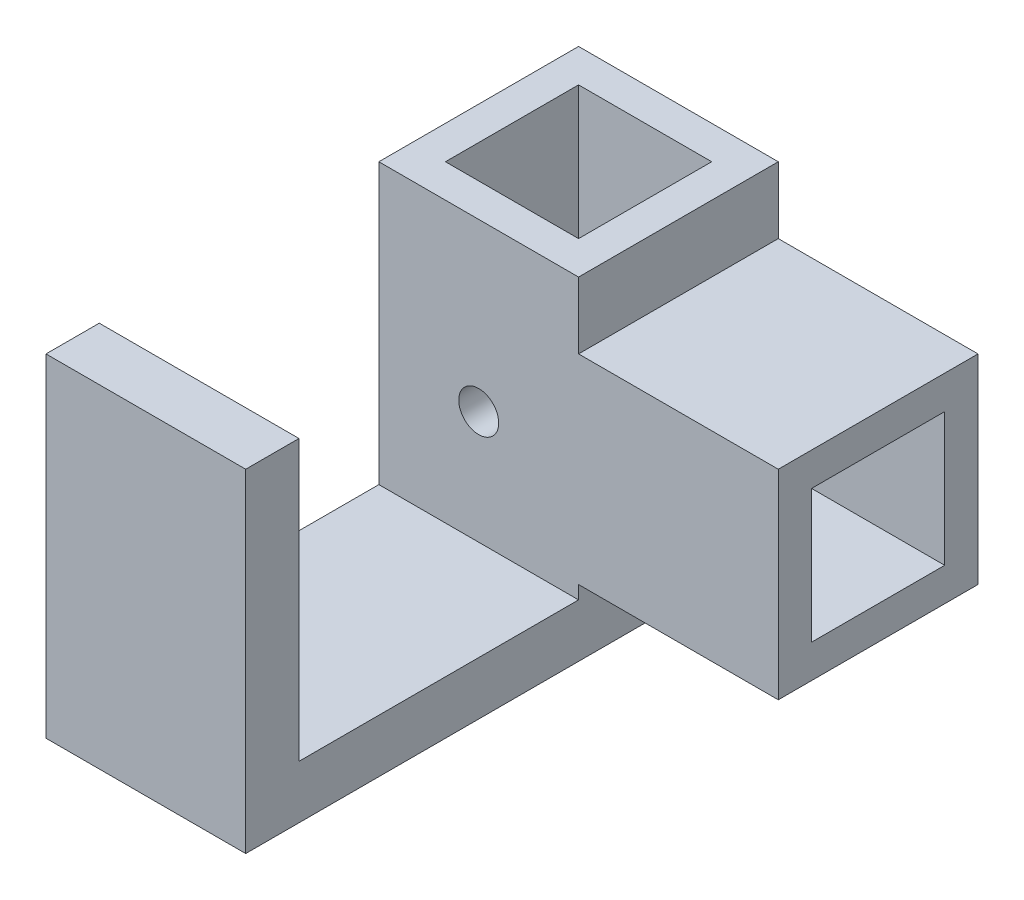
ISO-10303-21;
HEADER;
FILE_DESCRIPTION(('STEP AP214'),'2;1');
FILE_NAME('part.step','',(''),(''),'','','');
FILE_SCHEMA(('AUTOMOTIVE_DESIGN { 1 0 10303 214 1 1 1 1 }'));
ENDSEC;
DATA;
#1=APPLICATION_CONTEXT('core data for automotive mechanical design processes');
#2=APPLICATION_PROTOCOL_DEFINITION('international standard','automotive_design',2000,#1);
#3=PRODUCT_CONTEXT('',#1,'mechanical');
#4=PRODUCT('Part','Part','',(#3));
#5=PRODUCT_RELATED_PRODUCT_CATEGORY('part','',(#4));
#6=PRODUCT_DEFINITION_FORMATION('','',#4);
#7=PRODUCT_DEFINITION_CONTEXT('part definition',#1,'design');
#8=PRODUCT_DEFINITION('design','',#6,#7);
#9=PRODUCT_DEFINITION_SHAPE('','',#8);
#10=(LENGTH_UNIT() NAMED_UNIT(*) SI_UNIT(.MILLI.,.METRE.));
#11=(NAMED_UNIT(*) PLANE_ANGLE_UNIT() SI_UNIT($,.RADIAN.));
#12=(NAMED_UNIT(*) SI_UNIT($,.STERADIAN.) SOLID_ANGLE_UNIT());
#13=UNCERTAINTY_MEASURE_WITH_UNIT(LENGTH_MEASURE(1.E-05),#10,'distance_accuracy_value','');
#14=(GEOMETRIC_REPRESENTATION_CONTEXT(3) GLOBAL_UNCERTAINTY_ASSIGNED_CONTEXT((#13)) GLOBAL_UNIT_ASSIGNED_CONTEXT((#10,
#11,#12)) REPRESENTATION_CONTEXT('',''));
#15=CARTESIAN_POINT('',(0.,0.,0.));
#16=DIRECTION('',(0.,0.,1.));
#17=DIRECTION('',(1.,0.,0.));
#18=AXIS2_PLACEMENT_3D('',#15,#16,#17);
#19=CARTESIAN_POINT('',(0.,0.,15.));
#20=DIRECTION('',(0.,0.,1.));
#21=DIRECTION('',(1.,0.,0.));
#22=AXIS2_PLACEMENT_3D('',#19,#20,#21);
#23=PLANE('',#22);
#24=CARTESIAN_POINT('',(0.,0.,15.));
#25=DIRECTION('',(0.,0.,1.));
#26=DIRECTION('',(1.,0.,0.));
#27=AXIS2_PLACEMENT_3D('',#24,#25,#26);
#28=CIRCLE('',#27,3.);
#29=CARTESIAN_POINT('',(3.,0.,15.));
#30=VERTEX_POINT('',#29);
#31=EDGE_CURVE('E318',#30,#30,#28,.T.);
#32=ORIENTED_EDGE('',*,*,#31,.F.);
#33=EDGE_LOOP('',(#32));
#34=FACE_BOUND('',#33,.T.);
#35=DIRECTION('',(0.,-1.,0.));
#36=VECTOR('',#35,1.);
#37=CARTESIAN_POINT('',(-15.,-25.,15.));
#38=LINE('',#37,#36);
#39=CARTESIAN_POINT('',(-15.,25.,15.));
#40=VERTEX_POINT('',#39);
#41=CARTESIAN_POINT('',(-15.,-17.,15.));
#42=VERTEX_POINT('',#41);
#43=EDGE_CURVE('E330',#40,#42,#38,.T.);
#44=ORIENTED_EDGE('',*,*,#43,.T.);
#45=DIRECTION('',(1.,0.,0.));
#46=VECTOR('',#45,1.);
#47=CARTESIAN_POINT('',(-15.,-17.,15.));
#48=LINE('',#47,#46);
#49=CARTESIAN_POINT('',(15.,-17.,15.));
#50=VERTEX_POINT('',#49);
#51=EDGE_CURVE('E225',#42,#50,#48,.T.);
#52=ORIENTED_EDGE('',*,*,#51,.T.);
#53=DIRECTION('',(0.,1.,0.));
#54=VECTOR('',#53,1.);
#55=CARTESIAN_POINT('',(15.,-25.,15.));
#56=LINE('',#55,#54);
#57=CARTESIAN_POINT('',(15.,-15.,15.));
#58=VERTEX_POINT('',#57);
#59=EDGE_CURVE('E203',#50,#58,#56,.T.);
#60=ORIENTED_EDGE('',*,*,#59,.T.);
#61=DIRECTION('',(1.,0.,0.));
#62=VECTOR('',#61,1.);
#63=CARTESIAN_POINT('',(15.,-15.,15.));
#64=LINE('',#63,#62);
#65=CARTESIAN_POINT('',(45.,-15.,15.));
#66=VERTEX_POINT('',#65);
#67=EDGE_CURVE('E337',#58,#66,#64,.T.);
#68=ORIENTED_EDGE('',*,*,#67,.T.);
#69=DIRECTION('',(0.,1.,0.));
#70=VECTOR('',#69,1.);
#71=CARTESIAN_POINT('',(45.,15.,15.));
#72=LINE('',#71,#70);
#73=CARTESIAN_POINT('',(45.,15.,15.));
#74=VERTEX_POINT('',#73);
#75=EDGE_CURVE('E340',#66,#74,#72,.T.);
#76=ORIENTED_EDGE('',*,*,#75,.T.);
#77=DIRECTION('',(-1.,0.,0.));
#78=VECTOR('',#77,1.);
#79=CARTESIAN_POINT('',(15.,15.,15.));
#80=LINE('',#79,#78);
#81=CARTESIAN_POINT('',(15.,15.,15.));
#82=VERTEX_POINT('',#81);
#83=EDGE_CURVE('E343',#74,#82,#80,.T.);
#84=ORIENTED_EDGE('',*,*,#83,.T.);
#85=DIRECTION('',(0.,1.,0.));
#86=VECTOR('',#85,1.);
#87=CARTESIAN_POINT('',(15.,15.,15.));
#88=LINE('',#87,#86);
#89=CARTESIAN_POINT('',(15.,25.,15.));
#90=VERTEX_POINT('',#89);
#91=EDGE_CURVE('E346',#82,#90,#88,.T.);
#92=ORIENTED_EDGE('',*,*,#91,.T.);
#93=DIRECTION('',(-1.,0.,0.));
#94=VECTOR('',#93,1.);
#95=CARTESIAN_POINT('',(-15.,25.,15.));
#96=LINE('',#95,#94);
#97=EDGE_CURVE('E326',#90,#40,#96,.T.);
#98=ORIENTED_EDGE('',*,*,#97,.T.);
#99=EDGE_LOOP('',(#44,#52,#60,#68,#76,#84,#92,#98));
#100=FACE_BOUND('',#99,.T.);
#101=ADVANCED_FACE('F43',(#34,#100),#23,.T.);
#102=CARTESIAN_POINT('',(0.,0.,15.));
#103=DIRECTION('',(0.,0.,-1.));
#104=DIRECTION('',(-1.,0.,0.));
#105=AXIS2_PLACEMENT_3D('',#102,#103,#104);
#106=CYLINDRICAL_SURFACE('',#105,3.);
#107=CARTESIAN_POINT('',(0.,0.,10.));
#108=DIRECTION('',(0.,0.,1.));
#109=DIRECTION('',(1.,0.,0.));
#110=AXIS2_PLACEMENT_3D('',#107,#108,#109);
#111=CIRCLE('',#110,3.);
#112=CARTESIAN_POINT('',(3.,0.,10.));
#113=VERTEX_POINT('',#112);
#114=EDGE_CURVE('E312',#113,#113,#111,.T.);
#115=ORIENTED_EDGE('',*,*,#114,.F.);
#116=EDGE_LOOP('',(#115));
#117=FACE_BOUND('',#116,.T.);
#118=ORIENTED_EDGE('',*,*,#31,.T.);
#119=EDGE_LOOP('',(#118));
#120=FACE_BOUND('',#119,.T.);
#121=ADVANCED_FACE('F481',(#117,#120),#106,.F.);
#122=CARTESIAN_POINT('',(0.,0.,-15.));
#123=DIRECTION('',(0.,0.,1.));
#124=DIRECTION('',(1.,0.,0.));
#125=AXIS2_PLACEMENT_3D('',#122,#123,#124);
#126=PLANE('',#125);
#127=DIRECTION('',(-1.,0.,0.));
#128=VECTOR('',#127,1.);
#129=CARTESIAN_POINT('',(-15.,25.,-15.));
#130=LINE('',#129,#128);
#131=CARTESIAN_POINT('',(15.,25.,-15.));
#132=VERTEX_POINT('',#131);
#133=CARTESIAN_POINT('',(-15.,25.,-15.));
#134=VERTEX_POINT('',#133);
#135=EDGE_CURVE('E322',#132,#134,#130,.T.);
#136=ORIENTED_EDGE('',*,*,#135,.F.);
#137=DIRECTION('',(0.,1.,0.));
#138=VECTOR('',#137,1.);
#139=CARTESIAN_POINT('',(15.,15.,-15.));
#140=LINE('',#139,#138);
#141=CARTESIAN_POINT('',(15.,15.,-15.));
#142=VERTEX_POINT('',#141);
#143=EDGE_CURVE('E331',#142,#132,#140,.T.);
#144=ORIENTED_EDGE('',*,*,#143,.F.);
#145=DIRECTION('',(-1.,0.,0.));
#146=VECTOR('',#145,1.);
#147=CARTESIAN_POINT('',(15.,15.,-15.));
#148=LINE('',#147,#146);
#149=CARTESIAN_POINT('',(45.,15.,-15.));
#150=VERTEX_POINT('',#149);
#151=EDGE_CURVE('E368',#150,#142,#148,.T.);
#152=ORIENTED_EDGE('',*,*,#151,.F.);
#153=DIRECTION('',(0.,1.,0.));
#154=VECTOR('',#153,1.);
#155=CARTESIAN_POINT('',(45.,15.,-15.));
#156=LINE('',#155,#154);
#157=CARTESIAN_POINT('',(45.,-15.,-15.));
#158=VERTEX_POINT('',#157);
#159=EDGE_CURVE('E365',#158,#150,#156,.T.);
#160=ORIENTED_EDGE('',*,*,#159,.F.);
#161=DIRECTION('',(1.,0.,0.));
#162=VECTOR('',#161,1.);
#163=CARTESIAN_POINT('',(15.,-15.,-15.));
#164=LINE('',#163,#162);
#165=CARTESIAN_POINT('',(15.,-15.,-15.));
#166=VERTEX_POINT('',#165);
#167=EDGE_CURVE('E362',#166,#158,#164,.T.);
#168=ORIENTED_EDGE('',*,*,#167,.F.);
#169=DIRECTION('',(0.,1.,0.));
#170=VECTOR('',#169,1.);
#171=CARTESIAN_POINT('',(15.,-25.,-15.));
#172=LINE('',#171,#170);
#173=CARTESIAN_POINT('',(15.,-25.,-15.));
#174=VERTEX_POINT('',#173);
#175=EDGE_CURVE('E359',#174,#166,#172,.T.);
#176=ORIENTED_EDGE('',*,*,#175,.F.);
#177=DIRECTION('',(1.,0.,0.));
#178=VECTOR('',#177,1.);
#179=CARTESIAN_POINT('',(-15.,-25.,-15.));
#180=LINE('',#179,#178);
#181=CARTESIAN_POINT('',(-15.,-25.,-15.));
#182=VERTEX_POINT('',#181);
#183=EDGE_CURVE('E356',#182,#174,#180,.T.);
#184=ORIENTED_EDGE('',*,*,#183,.F.);
#185=DIRECTION('',(0.,-1.,0.));
#186=VECTOR('',#185,1.);
#187=CARTESIAN_POINT('',(-15.,-25.,-15.));
#188=LINE('',#187,#186);
#189=EDGE_CURVE('E353',#134,#182,#188,.T.);
#190=ORIENTED_EDGE('',*,*,#189,.F.);
#191=EDGE_LOOP('',(#136,#144,#152,#160,#168,#176,#184,#190));
#192=FACE_BOUND('',#191,.T.);
#193=CARTESIAN_POINT('',(0.,0.,-15.));
#194=DIRECTION('',(0.,0.,1.));
#195=DIRECTION('',(1.,0.,0.));
#196=AXIS2_PLACEMENT_3D('',#193,#194,#195);
#197=CIRCLE('',#196,3.);
#198=CARTESIAN_POINT('',(3.,0.,-15.));
#199=VERTEX_POINT('',#198);
#200=EDGE_CURVE('E317',#199,#199,#197,.T.);
#201=ORIENTED_EDGE('',*,*,#200,.T.);
#202=EDGE_LOOP('',(#201));
#203=FACE_BOUND('',#202,.T.);
#204=ADVANCED_FACE('F434',(#192,#203),#126,.F.);
#205=CARTESIAN_POINT('',(-15.,25.,15.));
#206=DIRECTION('',(0.,-1.,0.));
#207=DIRECTION('',(0.,0.,-1.));
#208=AXIS2_PLACEMENT_3D('',#205,#206,#207);
#209=PLANE('',#208);
#210=DIRECTION('',(-1.,0.,0.));
#211=VECTOR('',#210,1.);
#212=CARTESIAN_POINT('',(9.99999999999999,25.,-10.));
#213=LINE('',#212,#211);
#214=CARTESIAN_POINT('',(9.99999999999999,25.,-10.));
#215=VERTEX_POINT('',#214);
#216=CARTESIAN_POINT('',(-10.,25.,-10.));
#217=VERTEX_POINT('',#216);
#218=EDGE_CURVE('E282',#215,#217,#213,.T.);
#219=ORIENTED_EDGE('',*,*,#218,.F.);
#220=DIRECTION('',(0.,0.,-1.));
#221=VECTOR('',#220,1.);
#222=CARTESIAN_POINT('',(9.99999999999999,25.,10.));
#223=LINE('',#222,#221);
#224=CARTESIAN_POINT('',(9.99999999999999,25.,10.));
#225=VERTEX_POINT('',#224);
#226=EDGE_CURVE('E271',#225,#215,#223,.T.);
#227=ORIENTED_EDGE('',*,*,#226,.F.);
#228=DIRECTION('',(1.,0.,0.));
#229=VECTOR('',#228,1.);
#230=CARTESIAN_POINT('',(-10.,25.,10.));
#231=LINE('',#230,#229);
#232=CARTESIAN_POINT('',(-10.,25.,10.));
#233=VERTEX_POINT('',#232);
#234=EDGE_CURVE('E290',#233,#225,#231,.T.);
#235=ORIENTED_EDGE('',*,*,#234,.F.);
#236=DIRECTION('',(0.,0.,1.));
#237=VECTOR('',#236,1.);
#238=CARTESIAN_POINT('',(-10.,25.,-10.));
#239=LINE('',#238,#237);
#240=EDGE_CURVE('E286',#217,#233,#239,.T.);
#241=ORIENTED_EDGE('',*,*,#240,.F.);
#242=EDGE_LOOP('',(#219,#227,#235,#241));
#243=FACE_BOUND('',#242,.T.);
#244=ORIENTED_EDGE('',*,*,#135,.T.);
#245=DIRECTION('',(0.,0.,-1.));
#246=VECTOR('',#245,1.);
#247=CARTESIAN_POINT('',(-15.,25.,15.));
#248=LINE('',#247,#246);
#249=EDGE_CURVE('E400',#40,#134,#248,.T.);
#250=ORIENTED_EDGE('',*,*,#249,.F.);
#251=ORIENTED_EDGE('',*,*,#97,.F.);
#252=DIRECTION('',(0.,0.,-1.));
#253=VECTOR('',#252,1.);
#254=CARTESIAN_POINT('',(15.,25.,15.));
#255=LINE('',#254,#253);
#256=EDGE_CURVE('E349',#90,#132,#255,.T.);
#257=ORIENTED_EDGE('',*,*,#256,.T.);
#258=EDGE_LOOP('',(#244,#250,#251,#257));
#259=FACE_BOUND('',#258,.T.);
#260=ADVANCED_FACE('F45',(#243,#259),#209,.F.);
#261=CARTESIAN_POINT('',(-15.,-25.,15.));
#262=DIRECTION('',(1.,0.,0.));
#263=DIRECTION('',(0.,0.,-1.));
#264=AXIS2_PLACEMENT_3D('',#261,#262,#263);
#265=PLANE('',#264);
#266=ORIENTED_EDGE('',*,*,#189,.T.);
#267=DIRECTION('',(0.,0.,-1.));
#268=VECTOR('',#267,1.);
#269=CARTESIAN_POINT('',(-15.,-25.,15.));
#270=LINE('',#269,#268);
#271=CARTESIAN_POINT('',(-15.,-25.,65.));
#272=VERTEX_POINT('',#271);
#273=EDGE_CURVE('E396',#272,#182,#270,.T.);
#274=ORIENTED_EDGE('',*,*,#273,.F.);
#275=DIRECTION('',(0.,-1.,0.));
#276=VECTOR('',#275,1.);
#277=CARTESIAN_POINT('',(-15.,-25.,65.));
#278=LINE('',#277,#276);
#279=CARTESIAN_POINT('',(-15.,25.,65.));
#280=VERTEX_POINT('',#279);
#281=EDGE_CURVE('E189',#280,#272,#278,.T.);
#282=ORIENTED_EDGE('',*,*,#281,.F.);
#283=DIRECTION('',(0.,0.,1.));
#284=VECTOR('',#283,1.);
#285=CARTESIAN_POINT('',(-15.,25.,57.));
#286=LINE('',#285,#284);
#287=CARTESIAN_POINT('',(-15.,25.,57.));
#288=VERTEX_POINT('',#287);
#289=EDGE_CURVE('E218',#288,#280,#286,.T.);
#290=ORIENTED_EDGE('',*,*,#289,.F.);
#291=DIRECTION('',(0.,1.,0.));
#292=VECTOR('',#291,1.);
#293=CARTESIAN_POINT('',(-15.,-17.,57.));
#294=LINE('',#293,#292);
#295=CARTESIAN_POINT('',(-15.,-17.,57.));
#296=VERTEX_POINT('',#295);
#297=EDGE_CURVE('E215',#296,#288,#294,.T.);
#298=ORIENTED_EDGE('',*,*,#297,.F.);
#299=DIRECTION('',(0.,0.,1.));
#300=VECTOR('',#299,1.);
#301=CARTESIAN_POINT('',(-15.,-17.,15.));
#302=LINE('',#301,#300);
#303=EDGE_CURVE('E183',#42,#296,#302,.T.);
#304=ORIENTED_EDGE('',*,*,#303,.F.);
#305=ORIENTED_EDGE('',*,*,#43,.F.);
#306=ORIENTED_EDGE('',*,*,#249,.T.);
#307=EDGE_LOOP('',(#266,#274,#282,#290,#298,#304,#305,#306));
#308=FACE_BOUND('',#307,.T.);
#309=ADVANCED_FACE('F433',(#308),#265,.F.);
#310=CARTESIAN_POINT('',(-15.,-25.,15.));
#311=DIRECTION('',(0.,1.,0.));
#312=DIRECTION('',(0.,0.,1.));
#313=AXIS2_PLACEMENT_3D('',#310,#311,#312);
#314=PLANE('',#313);
#315=DIRECTION('',(1.,0.,0.));
#316=VECTOR('',#315,1.);
#317=CARTESIAN_POINT('',(-15.,-25.,10.));
#318=LINE('',#317,#316);
#319=CARTESIAN_POINT('',(-10.,-25.,10.));
#320=VERTEX_POINT('',#319);
#321=CARTESIAN_POINT('',(9.99999999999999,-25.,10.));
#322=VERTEX_POINT('',#321);
#323=EDGE_CURVE('E313',#320,#322,#318,.T.);
#324=ORIENTED_EDGE('',*,*,#323,.T.);
#325=DIRECTION('',(0.,0.,-1.));
#326=VECTOR('',#325,1.);
#327=CARTESIAN_POINT('',(9.99999999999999,-25.,15.));
#328=LINE('',#327,#326);
#329=CARTESIAN_POINT('',(9.99999999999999,-25.,-10.));
#330=VERTEX_POINT('',#329);
#331=EDGE_CURVE('E11',#322,#330,#328,.T.);
#332=ORIENTED_EDGE('',*,*,#331,.T.);
#333=DIRECTION('',(-1.,0.,0.));
#334=VECTOR('',#333,1.);
#335=CARTESIAN_POINT('',(-15.,-25.,-10.));
#336=LINE('',#335,#334);
#337=CARTESIAN_POINT('',(-10.,-25.,-10.));
#338=VERTEX_POINT('',#337);
#339=EDGE_CURVE('E308',#330,#338,#336,.T.);
#340=ORIENTED_EDGE('',*,*,#339,.T.);
#341=DIRECTION('',(0.,0.,1.));
#342=VECTOR('',#341,1.);
#343=CARTESIAN_POINT('',(-10.,-25.,15.));
#344=LINE('',#343,#342);
#345=EDGE_CURVE('E52',#338,#320,#344,.T.);
#346=ORIENTED_EDGE('',*,*,#345,.T.);
#347=EDGE_LOOP('',(#324,#332,#340,#346));
#348=FACE_BOUND('',#347,.T.);
#349=ORIENTED_EDGE('',*,*,#183,.T.);
#350=DIRECTION('',(0.,0.,-1.));
#351=VECTOR('',#350,1.);
#352=CARTESIAN_POINT('',(15.,-25.,15.));
#353=LINE('',#352,#351);
#354=CARTESIAN_POINT('',(15.,-25.,65.));
#355=VERTEX_POINT('',#354);
#356=EDGE_CURVE('E392',#355,#174,#353,.T.);
#357=ORIENTED_EDGE('',*,*,#356,.F.);
#358=DIRECTION('',(1.,0.,0.));
#359=VECTOR('',#358,1.);
#360=CARTESIAN_POINT('',(-15.,-25.,65.));
#361=LINE('',#360,#359);
#362=EDGE_CURVE('E228',#272,#355,#361,.T.);
#363=ORIENTED_EDGE('',*,*,#362,.F.);
#364=ORIENTED_EDGE('',*,*,#273,.T.);
#365=EDGE_LOOP('',(#349,#357,#363,#364));
#366=FACE_BOUND('',#365,.T.);
#367=ADVANCED_FACE('F413',(#348,#366),#314,.F.);
#368=CARTESIAN_POINT('',(15.,-25.,15.));
#369=DIRECTION('',(-1.,0.,0.));
#370=DIRECTION('',(0.,-1.,0.));
#371=AXIS2_PLACEMENT_3D('',#368,#369,#370);
#372=PLANE('',#371);
#373=ORIENTED_EDGE('',*,*,#175,.T.);
#374=DIRECTION('',(0.,0.,-1.));
#375=VECTOR('',#374,1.);
#376=CARTESIAN_POINT('',(15.,-15.,15.));
#377=LINE('',#376,#375);
#378=EDGE_CURVE('E388',#58,#166,#377,.T.);
#379=ORIENTED_EDGE('',*,*,#378,.F.);
#380=ORIENTED_EDGE('',*,*,#59,.F.);
#381=DIRECTION('',(0.,0.,1.));
#382=VECTOR('',#381,1.);
#383=CARTESIAN_POINT('',(15.,-17.,15.));
#384=LINE('',#383,#382);
#385=CARTESIAN_POINT('',(15.,-17.,57.));
#386=VERTEX_POINT('',#385);
#387=EDGE_CURVE('E59',#50,#386,#384,.T.);
#388=ORIENTED_EDGE('',*,*,#387,.T.);
#389=DIRECTION('',(0.,1.,0.));
#390=VECTOR('',#389,1.);
#391=CARTESIAN_POINT('',(15.,-17.,57.));
#392=LINE('',#391,#390);
#393=CARTESIAN_POINT('',(15.,25.,57.));
#394=VERTEX_POINT('',#393);
#395=EDGE_CURVE('E192',#386,#394,#392,.T.);
#396=ORIENTED_EDGE('',*,*,#395,.T.);
#397=DIRECTION('',(0.,0.,1.));
#398=VECTOR('',#397,1.);
#399=CARTESIAN_POINT('',(15.,25.,57.));
#400=LINE('',#399,#398);
#401=CARTESIAN_POINT('',(15.,25.,65.));
#402=VERTEX_POINT('',#401);
#403=EDGE_CURVE('E198',#394,#402,#400,.T.);
#404=ORIENTED_EDGE('',*,*,#403,.T.);
#405=DIRECTION('',(0.,-1.,0.));
#406=VECTOR('',#405,1.);
#407=CARTESIAN_POINT('',(15.,-25.,65.));
#408=LINE('',#407,#406);
#409=EDGE_CURVE('E209',#402,#355,#408,.T.);
#410=ORIENTED_EDGE('',*,*,#409,.T.);
#411=ORIENTED_EDGE('',*,*,#356,.T.);
#412=EDGE_LOOP('',(#373,#379,#380,#388,#396,#404,#410,#411));
#413=FACE_BOUND('',#412,.T.);
#414=ADVANCED_FACE('F201',(#413),#372,.F.);
#415=CARTESIAN_POINT('',(15.,-15.,15.));
#416=DIRECTION('',(0.,1.,0.));
#417=DIRECTION('',(0.,0.,1.));
#418=AXIS2_PLACEMENT_3D('',#415,#416,#417);
#419=PLANE('',#418);
#420=ORIENTED_EDGE('',*,*,#167,.T.);
#421=DIRECTION('',(0.,0.,-1.));
#422=VECTOR('',#421,1.);
#423=CARTESIAN_POINT('',(45.,-15.,15.));
#424=LINE('',#423,#422);
#425=EDGE_CURVE('E384',#66,#158,#424,.T.);
#426=ORIENTED_EDGE('',*,*,#425,.F.);
#427=ORIENTED_EDGE('',*,*,#67,.F.);
#428=ORIENTED_EDGE('',*,*,#378,.T.);
#429=EDGE_LOOP('',(#420,#426,#427,#428));
#430=FACE_BOUND('',#429,.T.);
#431=ADVANCED_FACE('F463',(#430),#419,.F.);
#432=CARTESIAN_POINT('',(45.,15.,15.));
#433=DIRECTION('',(-1.,0.,0.));
#434=DIRECTION('',(0.,0.,1.));
#435=AXIS2_PLACEMENT_3D('',#432,#433,#434);
#436=PLANE('',#435);
#437=DIRECTION('',(0.,1.,0.));
#438=VECTOR('',#437,1.);
#439=CARTESIAN_POINT('',(45.,-10.,-10.));
#440=LINE('',#439,#438);
#441=CARTESIAN_POINT('',(45.,-9.99999999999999,-10.));
#442=VERTEX_POINT('',#441);
#443=CARTESIAN_POINT('',(45.,10.,-10.));
#444=VERTEX_POINT('',#443);
#445=EDGE_CURVE('E257',#442,#444,#440,.T.);
#446=ORIENTED_EDGE('',*,*,#445,.F.);
#447=DIRECTION('',(0.,0.,-1.));
#448=VECTOR('',#447,1.);
#449=CARTESIAN_POINT('',(45.,-10.,10.));
#450=LINE('',#449,#448);
#451=CARTESIAN_POINT('',(45.,-10.,10.));
#452=VERTEX_POINT('',#451);
#453=EDGE_CURVE('E67',#452,#442,#450,.T.);
#454=ORIENTED_EDGE('',*,*,#453,.F.);
#455=DIRECTION('',(0.,-1.,0.));
#456=VECTOR('',#455,1.);
#457=CARTESIAN_POINT('',(45.,10.,10.));
#458=LINE('',#457,#456);
#459=CARTESIAN_POINT('',(45.,10.,10.));
#460=VERTEX_POINT('',#459);
#461=EDGE_CURVE('E242',#460,#452,#458,.T.);
#462=ORIENTED_EDGE('',*,*,#461,.F.);
#463=DIRECTION('',(0.,0.,1.));
#464=VECTOR('',#463,1.);
#465=CARTESIAN_POINT('',(45.,10.,-10.));
#466=LINE('',#465,#464);
#467=EDGE_CURVE('E261',#444,#460,#466,.T.);
#468=ORIENTED_EDGE('',*,*,#467,.F.);
#469=EDGE_LOOP('',(#446,#454,#462,#468));
#470=FACE_BOUND('',#469,.T.);
#471=ORIENTED_EDGE('',*,*,#159,.T.);
#472=DIRECTION('',(0.,0.,-1.));
#473=VECTOR('',#472,1.);
#474=CARTESIAN_POINT('',(45.,15.,15.));
#475=LINE('',#474,#473);
#476=EDGE_CURVE('E380',#74,#150,#475,.T.);
#477=ORIENTED_EDGE('',*,*,#476,.F.);
#478=ORIENTED_EDGE('',*,*,#75,.F.);
#479=ORIENTED_EDGE('',*,*,#425,.T.);
#480=EDGE_LOOP('',(#471,#477,#478,#479));
#481=FACE_BOUND('',#480,.T.);
#482=ADVANCED_FACE('F458',(#470,#481),#436,.F.);
#483=CARTESIAN_POINT('',(15.,15.,15.));
#484=DIRECTION('',(0.,-1.,0.));
#485=DIRECTION('',(0.,0.,-1.));
#486=AXIS2_PLACEMENT_3D('',#483,#484,#485);
#487=PLANE('',#486);
#488=ORIENTED_EDGE('',*,*,#151,.T.);
#489=DIRECTION('',(0.,0.,-1.));
#490=VECTOR('',#489,1.);
#491=CARTESIAN_POINT('',(15.,15.,15.));
#492=LINE('',#491,#490);
#493=EDGE_CURVE('E376',#82,#142,#492,.T.);
#494=ORIENTED_EDGE('',*,*,#493,.F.);
#495=ORIENTED_EDGE('',*,*,#83,.F.);
#496=ORIENTED_EDGE('',*,*,#476,.T.);
#497=EDGE_LOOP('',(#488,#494,#495,#496));
#498=FACE_BOUND('',#497,.T.);
#499=ADVANCED_FACE('F453',(#498),#487,.F.);
#500=CARTESIAN_POINT('',(15.,15.,15.));
#501=DIRECTION('',(-1.,0.,0.));
#502=DIRECTION('',(0.,-1.,0.));
#503=AXIS2_PLACEMENT_3D('',#500,#501,#502);
#504=PLANE('',#503);
#505=ORIENTED_EDGE('',*,*,#143,.T.);
#506=ORIENTED_EDGE('',*,*,#256,.F.);
#507=ORIENTED_EDGE('',*,*,#91,.F.);
#508=ORIENTED_EDGE('',*,*,#493,.T.);
#509=EDGE_LOOP('',(#505,#506,#507,#508));
#510=FACE_BOUND('',#509,.T.);
#511=ADVANCED_FACE('F451',(#510),#504,.F.);
#512=CARTESIAN_POINT('',(0.,0.,-10.));
#513=DIRECTION('',(0.,0.,-1.));
#514=DIRECTION('',(-1.,0.,0.));
#515=AXIS2_PLACEMENT_3D('',#512,#513,#514);
#516=CIRCLE('',#515,3.);
#517=CARTESIAN_POINT('',(-3.,0.,-10.));
#518=VERTEX_POINT('',#517);
#519=EDGE_CURVE('E298',#518,#518,#516,.T.);
#520=ORIENTED_EDGE('',*,*,#519,.F.);
#521=EDGE_LOOP('',(#520));
#522=FACE_BOUND('',#521,.T.);
#523=ORIENTED_EDGE('',*,*,#200,.F.);
#524=EDGE_LOOP('',(#523));
#525=FACE_BOUND('',#524,.T.);
#526=ADVANCED_FACE('F491',(#522,#525),#106,.F.);
#527=CARTESIAN_POINT('',(9.99999999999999,-34.,10.));
#528=DIRECTION('',(1.,0.,0.));
#529=DIRECTION('',(0.,0.,-1.));
#530=AXIS2_PLACEMENT_3D('',#527,#528,#529);
#531=PLANE('',#530);
#532=DIRECTION('',(0.,1.,0.));
#533=VECTOR('',#532,1.);
#534=CARTESIAN_POINT('',(9.99999999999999,-34.,10.));
#535=LINE('',#534,#533);
#536=EDGE_CURVE('E295',#322,#225,#535,.T.);
#537=ORIENTED_EDGE('',*,*,#536,.T.);
#538=ORIENTED_EDGE('',*,*,#226,.T.);
#539=DIRECTION('',(0.,1.,0.));
#540=VECTOR('',#539,1.);
#541=CARTESIAN_POINT('',(9.99999999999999,-34.,-10.));
#542=LINE('',#541,#540);
#543=EDGE_CURVE('E294',#330,#215,#542,.T.);
#544=ORIENTED_EDGE('',*,*,#543,.F.);
#545=ORIENTED_EDGE('',*,*,#331,.F.);
#546=EDGE_LOOP('',(#537,#538,#544,#545));
#547=FACE_BOUND('',#546,.T.);
#548=ADVANCED_FACE('F425',(#547),#531,.F.);
#549=CARTESIAN_POINT('',(-10.,-34.,-10.));
#550=DIRECTION('',(-1.,0.,0.));
#551=DIRECTION('',(0.,0.,1.));
#552=AXIS2_PLACEMENT_3D('',#549,#550,#551);
#553=PLANE('',#552);
#554=DIRECTION('',(0.,1.,0.));
#555=VECTOR('',#554,1.);
#556=CARTESIAN_POINT('',(-10.,-34.,-10.));
#557=LINE('',#556,#555);
#558=EDGE_CURVE('E302',#338,#217,#557,.T.);
#559=ORIENTED_EDGE('',*,*,#558,.T.);
#560=ORIENTED_EDGE('',*,*,#240,.T.);
#561=DIRECTION('',(0.,1.,0.));
#562=VECTOR('',#561,1.);
#563=CARTESIAN_POINT('',(-10.,-34.,10.));
#564=LINE('',#563,#562);
#565=EDGE_CURVE('E299',#320,#233,#564,.T.);
#566=ORIENTED_EDGE('',*,*,#565,.F.);
#567=ORIENTED_EDGE('',*,*,#345,.F.);
#568=EDGE_LOOP('',(#559,#560,#566,#567));
#569=FACE_BOUND('',#568,.T.);
#570=ADVANCED_FACE('F417',(#569),#553,.F.);
#571=CARTESIAN_POINT('',(-10.,-34.,10.));
#572=DIRECTION('',(0.,0.,1.));
#573=DIRECTION('',(1.,0.,0.));
#574=AXIS2_PLACEMENT_3D('',#571,#572,#573);
#575=PLANE('',#574);
#576=ORIENTED_EDGE('',*,*,#114,.T.);
#577=EDGE_LOOP('',(#576));
#578=FACE_BOUND('',#577,.T.);
#579=ORIENTED_EDGE('',*,*,#565,.T.);
#580=ORIENTED_EDGE('',*,*,#234,.T.);
#581=ORIENTED_EDGE('',*,*,#536,.F.);
#582=ORIENTED_EDGE('',*,*,#323,.F.);
#583=EDGE_LOOP('',(#579,#580,#581,#582));
#584=FACE_BOUND('',#583,.T.);
#585=ADVANCED_FACE('F421',(#578,#584),#575,.F.);
#586=CARTESIAN_POINT('',(9.99999999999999,-34.,-10.));
#587=DIRECTION('',(0.,0.,-1.));
#588=DIRECTION('',(-1.,0.,0.));
#589=AXIS2_PLACEMENT_3D('',#586,#587,#588);
#590=PLANE('',#589);
#591=ORIENTED_EDGE('',*,*,#519,.T.);
#592=EDGE_LOOP('',(#591));
#593=FACE_BOUND('',#592,.T.);
#594=ORIENTED_EDGE('',*,*,#543,.T.);
#595=ORIENTED_EDGE('',*,*,#218,.T.);
#596=ORIENTED_EDGE('',*,*,#558,.F.);
#597=ORIENTED_EDGE('',*,*,#339,.F.);
#598=EDGE_LOOP('',(#594,#595,#596,#597));
#599=FACE_BOUND('',#598,.T.);
#600=ADVANCED_FACE('F429',(#593,#599),#590,.F.);
#601=CARTESIAN_POINT('',(20.,-10.,10.));
#602=DIRECTION('',(0.,-1.,0.));
#603=DIRECTION('',(0.,0.,-1.));
#604=AXIS2_PLACEMENT_3D('',#601,#602,#603);
#605=PLANE('',#604);
#606=ORIENTED_EDGE('',*,*,#453,.T.);
#607=DIRECTION('',(1.,0.,0.));
#608=VECTOR('',#607,1.);
#609=CARTESIAN_POINT('',(20.,-10.,-10.));
#610=LINE('',#609,#608);
#611=CARTESIAN_POINT('',(20.,-10.,-10.));
#612=VERTEX_POINT('',#611);
#613=EDGE_CURVE('E254',#612,#442,#610,.T.);
#614=ORIENTED_EDGE('',*,*,#613,.F.);
#615=DIRECTION('',(0.,0.,-1.));
#616=VECTOR('',#615,1.);
#617=CARTESIAN_POINT('',(20.,-10.,10.));
#618=LINE('',#617,#616);
#619=CARTESIAN_POINT('',(20.,-10.,10.));
#620=VERTEX_POINT('',#619);
#621=EDGE_CURVE('E237',#620,#612,#618,.T.);
#622=ORIENTED_EDGE('',*,*,#621,.F.);
#623=DIRECTION('',(1.,0.,0.));
#624=VECTOR('',#623,1.);
#625=CARTESIAN_POINT('',(20.,-10.,10.));
#626=LINE('',#625,#624);
#627=EDGE_CURVE('E268',#620,#452,#626,.T.);
#628=ORIENTED_EDGE('',*,*,#627,.T.);
#629=EDGE_LOOP('',(#606,#614,#622,#628));
#630=FACE_BOUND('',#629,.T.);
#631=ADVANCED_FACE('F594',(#630),#605,.F.);
#632=CARTESIAN_POINT('',(20.,10.,10.));
#633=DIRECTION('',(0.,0.,1.));
#634=DIRECTION('',(1.,0.,0.));
#635=AXIS2_PLACEMENT_3D('',#632,#633,#634);
#636=PLANE('',#635);
#637=ORIENTED_EDGE('',*,*,#461,.T.);
#638=ORIENTED_EDGE('',*,*,#627,.F.);
#639=DIRECTION('',(0.,-1.,0.));
#640=VECTOR('',#639,1.);
#641=CARTESIAN_POINT('',(20.,10.,10.));
#642=LINE('',#641,#640);
#643=CARTESIAN_POINT('',(20.,10.,10.));
#644=VERTEX_POINT('',#643);
#645=EDGE_CURVE('E250',#644,#620,#642,.T.);
#646=ORIENTED_EDGE('',*,*,#645,.F.);
#647=DIRECTION('',(1.,0.,0.));
#648=VECTOR('',#647,1.);
#649=CARTESIAN_POINT('',(20.,10.,10.));
#650=LINE('',#649,#648);
#651=EDGE_CURVE('E272',#644,#460,#650,.T.);
#652=ORIENTED_EDGE('',*,*,#651,.T.);
#653=EDGE_LOOP('',(#637,#638,#646,#652));
#654=FACE_BOUND('',#653,.T.);
#655=ADVANCED_FACE('F584',(#654),#636,.F.);
#656=CARTESIAN_POINT('',(20.,10.,-10.));
#657=DIRECTION('',(0.,1.,0.));
#658=DIRECTION('',(0.,0.,1.));
#659=AXIS2_PLACEMENT_3D('',#656,#657,#658);
#660=PLANE('',#659);
#661=ORIENTED_EDGE('',*,*,#467,.T.);
#662=ORIENTED_EDGE('',*,*,#651,.F.);
#663=DIRECTION('',(0.,0.,1.));
#664=VECTOR('',#663,1.);
#665=CARTESIAN_POINT('',(20.,10.,-10.));
#666=LINE('',#665,#664);
#667=CARTESIAN_POINT('',(20.,10.,-10.));
#668=VERTEX_POINT('',#667);
#669=EDGE_CURVE('E246',#668,#644,#666,.T.);
#670=ORIENTED_EDGE('',*,*,#669,.F.);
#671=DIRECTION('',(1.,0.,0.));
#672=VECTOR('',#671,1.);
#673=CARTESIAN_POINT('',(20.,10.,-10.));
#674=LINE('',#673,#672);
#675=EDGE_CURVE('E275',#668,#444,#674,.T.);
#676=ORIENTED_EDGE('',*,*,#675,.T.);
#677=EDGE_LOOP('',(#661,#662,#670,#676));
#678=FACE_BOUND('',#677,.T.);
#679=ADVANCED_FACE('F574',(#678),#660,.F.);
#680=CARTESIAN_POINT('',(20.,-10.,-10.));
#681=DIRECTION('',(0.,0.,-1.));
#682=DIRECTION('',(-1.,0.,0.));
#683=AXIS2_PLACEMENT_3D('',#680,#681,#682);
#684=PLANE('',#683);
#685=ORIENTED_EDGE('',*,*,#445,.T.);
#686=ORIENTED_EDGE('',*,*,#675,.F.);
#687=DIRECTION('',(0.,1.,0.));
#688=VECTOR('',#687,1.);
#689=CARTESIAN_POINT('',(20.,-10.,-10.));
#690=LINE('',#689,#688);
#691=EDGE_CURVE('E241',#612,#668,#690,.T.);
#692=ORIENTED_EDGE('',*,*,#691,.F.);
#693=ORIENTED_EDGE('',*,*,#613,.T.);
#694=EDGE_LOOP('',(#685,#686,#692,#693));
#695=FACE_BOUND('',#694,.T.);
#696=ADVANCED_FACE('F565',(#695),#684,.F.);
#697=CARTESIAN_POINT('',(20.,0.,0.));
#698=DIRECTION('',(1.,0.,0.));
#699=DIRECTION('',(0.,0.,-1.));
#700=AXIS2_PLACEMENT_3D('',#697,#698,#699);
#701=PLANE('',#700);
#702=ORIENTED_EDGE('',*,*,#621,.T.);
#703=ORIENTED_EDGE('',*,*,#691,.T.);
#704=ORIENTED_EDGE('',*,*,#669,.T.);
#705=ORIENTED_EDGE('',*,*,#645,.T.);
#706=EDGE_LOOP('',(#702,#703,#704,#705));
#707=FACE_BOUND('',#706,.T.);
#708=ADVANCED_FACE('F528',(#707),#701,.T.);
#709=CARTESIAN_POINT('',(-15.,-17.,15.));
#710=DIRECTION('',(0.,1.,0.));
#711=DIRECTION('',(0.,0.,1.));
#712=AXIS2_PLACEMENT_3D('',#709,#710,#711);
#713=PLANE('',#712);
#714=DIRECTION('',(1.,0.,0.));
#715=VECTOR('',#714,1.);
#716=CARTESIAN_POINT('',(-15.,-17.,57.));
#717=LINE('',#716,#715);
#718=EDGE_CURVE('E179',#296,#386,#717,.T.);
#719=ORIENTED_EDGE('',*,*,#718,.T.);
#720=ORIENTED_EDGE('',*,*,#387,.F.);
#721=ORIENTED_EDGE('',*,*,#51,.F.);
#722=ORIENTED_EDGE('',*,*,#303,.T.);
#723=EDGE_LOOP('',(#719,#720,#721,#722));
#724=FACE_BOUND('',#723,.T.);
#725=ADVANCED_FACE('F181',(#724),#713,.T.);
#726=CARTESIAN_POINT('',(-15.,-25.,65.));
#727=DIRECTION('',(0.,0.,1.));
#728=DIRECTION('',(1.,0.,0.));
#729=AXIS2_PLACEMENT_3D('',#726,#727,#728);
#730=PLANE('',#729);
#731=ORIENTED_EDGE('',*,*,#362,.T.);
#732=ORIENTED_EDGE('',*,*,#409,.F.);
#733=DIRECTION('',(1.,0.,0.));
#734=VECTOR('',#733,1.);
#735=CARTESIAN_POINT('',(-15.,25.,65.));
#736=LINE('',#735,#734);
#737=EDGE_CURVE('E232',#280,#402,#736,.T.);
#738=ORIENTED_EDGE('',*,*,#737,.F.);
#739=ORIENTED_EDGE('',*,*,#281,.T.);
#740=EDGE_LOOP('',(#731,#732,#738,#739));
#741=FACE_BOUND('',#740,.T.);
#742=ADVANCED_FACE('F467',(#741),#730,.T.);
#743=CARTESIAN_POINT('',(-15.,25.,57.));
#744=DIRECTION('',(0.,1.,0.));
#745=DIRECTION('',(0.,0.,1.));
#746=AXIS2_PLACEMENT_3D('',#743,#744,#745);
#747=PLANE('',#746);
#748=ORIENTED_EDGE('',*,*,#737,.T.);
#749=ORIENTED_EDGE('',*,*,#403,.F.);
#750=DIRECTION('',(1.,0.,0.));
#751=VECTOR('',#750,1.);
#752=CARTESIAN_POINT('',(-15.,25.,57.));
#753=LINE('',#752,#751);
#754=EDGE_CURVE('E188',#288,#394,#753,.T.);
#755=ORIENTED_EDGE('',*,*,#754,.F.);
#756=ORIENTED_EDGE('',*,*,#289,.T.);
#757=EDGE_LOOP('',(#748,#749,#755,#756));
#758=FACE_BOUND('',#757,.T.);
#759=ADVANCED_FACE('F471',(#758),#747,.T.);
#760=CARTESIAN_POINT('',(-15.,-17.,57.));
#761=DIRECTION('',(0.,0.,-1.));
#762=DIRECTION('',(-1.,0.,0.));
#763=AXIS2_PLACEMENT_3D('',#760,#761,#762);
#764=PLANE('',#763);
#765=ORIENTED_EDGE('',*,*,#754,.T.);
#766=ORIENTED_EDGE('',*,*,#395,.F.);
#767=ORIENTED_EDGE('',*,*,#718,.F.);
#768=ORIENTED_EDGE('',*,*,#297,.T.);
#769=EDGE_LOOP('',(#765,#766,#767,#768));
#770=FACE_BOUND('',#769,.T.);
#771=ADVANCED_FACE('F193',(#770),#764,.T.);
#772=CLOSED_SHELL('',(#101,#121,#204,#260,#309,#367,#414,#431,#482,#499,#511,#526,#548,#570,
#585,#600,#631,#655,#679,#696,#708,#725,#742,#759,#771));
#773=MANIFOLD_SOLID_BREP('B2',#772);
#774=ADVANCED_BREP_SHAPE_REPRESENTATION('',(#18,#773),#14);
#775=SHAPE_DEFINITION_REPRESENTATION(#9,#774);
ENDSEC;
END-ISO-10303-21;
